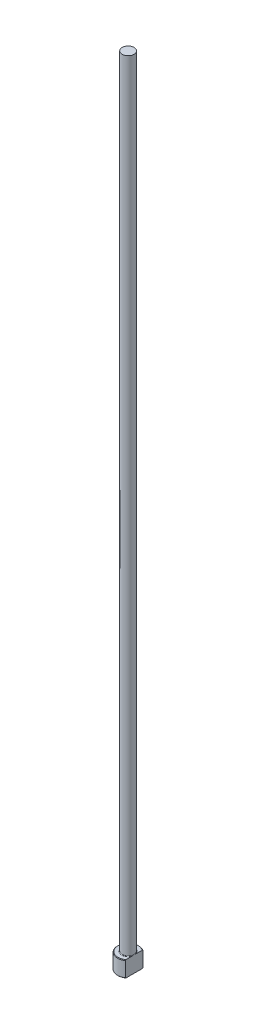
from build123d import *
from build123d.topology import SkipClean

# Parameters (mm, degrees)
CHAMFER1_SIZE    = 0.2
FILLET1_R        = 0.2
KEYED_HEAD_DEPTH = 301.053328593


with BuildPart() as part:
    # Sketch1 → Revolve1 (revolve)
    with BuildSketch(Plane.XY, mode=Mode.PRIVATE) as revolve1_sk:
        Polygon((0, 0), (-4, 0), (-4, 6), (-2.25, 6), (-2.25, 300), (0, 300), align=None)
    revolve(revolve1_sk.sketch.rotate(Axis((0, 259.958771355, 0), (0, -1, 0)), 270), axis=Axis((0, 259.958771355, 0), (0, -1, 0)))

    # Chamfer1
    chamfer1_edges = [part.edges().sort_by_distance(p)[0] for p in [
        (0, 6, -4),
        (0, 0, -4),
    ]]
    chamfer(chamfer1_edges, length=CHAMFER1_SIZE)

    # Fillet1
    fillet1_edges = [part.edges().sort_by_distance(p)[0] for p in [
        (0, 6, -2.25),
    ]]
    fillet(fillet1_edges, radius=FILLET1_R)

    # Sketch2 → KEYED HEAD (cut, through all)
    with SkipClean():  # the faces are left unmerged after this step: merging them gives an invalid solid
        with BuildSketch(Plane(origin=(0, 0, 0), x_dir=(1, 0, 0), z_dir=(0, 1, 0))):
            with BuildLine():
                Line((2.25, -3.307189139), (2.25, 3.307189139))
                ThreePointArc((2.25, 3.307189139), (4, 0), (2.25, -3.307189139))
            make_face()
        extrude(amount=KEYED_HEAD_DEPTH, mode=Mode.SUBTRACT)


solid = part.part
